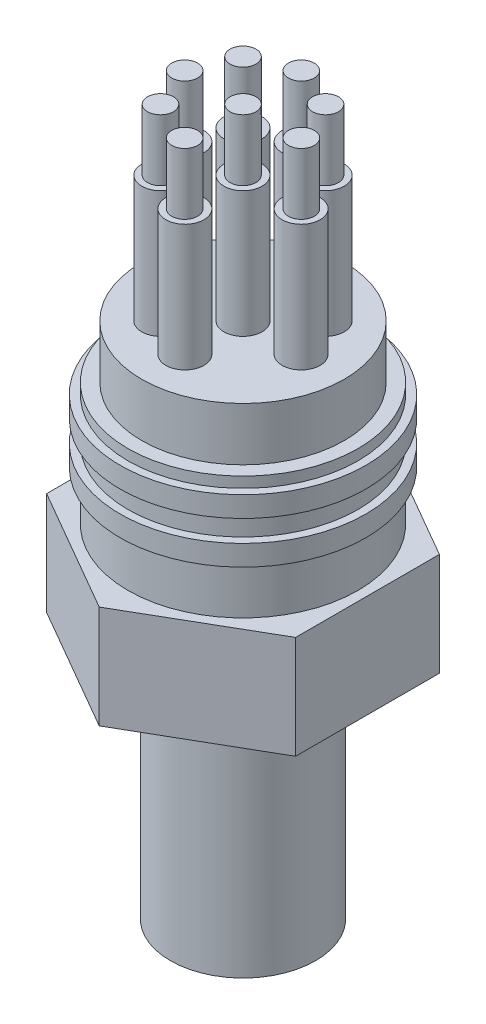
ISO-10303-21;
HEADER;
FILE_DESCRIPTION(('STEP AP214'),'2;1');
FILE_NAME('part.step','',(''),(''),'','','');
FILE_SCHEMA(('AUTOMOTIVE_DESIGN { 1 0 10303 214 1 1 1 1 }'));
ENDSEC;
DATA;
#1=APPLICATION_CONTEXT('core data for automotive mechanical design processes');
#2=APPLICATION_PROTOCOL_DEFINITION('international standard','automotive_design',2000,#1);
#3=PRODUCT_CONTEXT('',#1,'mechanical');
#4=PRODUCT('Part','Part','',(#3));
#5=PRODUCT_RELATED_PRODUCT_CATEGORY('part','',(#4));
#6=PRODUCT_DEFINITION_FORMATION('','',#4);
#7=PRODUCT_DEFINITION_CONTEXT('part definition',#1,'design');
#8=PRODUCT_DEFINITION('design','',#6,#7);
#9=PRODUCT_DEFINITION_SHAPE('','',#8);
#10=(LENGTH_UNIT() NAMED_UNIT(*) SI_UNIT(.MILLI.,.METRE.));
#11=(NAMED_UNIT(*) PLANE_ANGLE_UNIT() SI_UNIT($,.RADIAN.));
#12=(NAMED_UNIT(*) SI_UNIT($,.STERADIAN.) SOLID_ANGLE_UNIT());
#13=UNCERTAINTY_MEASURE_WITH_UNIT(LENGTH_MEASURE(1.E-05),#10,'distance_accuracy_value','');
#14=(GEOMETRIC_REPRESENTATION_CONTEXT(3) GLOBAL_UNCERTAINTY_ASSIGNED_CONTEXT((#13)) GLOBAL_UNIT_ASSIGNED_CONTEXT((#10,
#11,#12)) REPRESENTATION_CONTEXT('',''));
#15=CARTESIAN_POINT('',(0.,0.,0.));
#16=DIRECTION('',(0.,0.,1.));
#17=DIRECTION('',(1.,0.,0.));
#18=AXIS2_PLACEMENT_3D('',#15,#16,#17);
#19=CARTESIAN_POINT('',(9.52499999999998,7.874,-5.4992613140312));
#20=DIRECTION('',(-0.5,0.,0.866025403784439));
#21=DIRECTION('',(0.866025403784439,0.,0.5));
#22=AXIS2_PLACEMENT_3D('',#19,#20,#21);
#23=PLANE('',#22);
#24=DIRECTION('',(-0.866025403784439,0.,-0.5));
#25=VECTOR('',#24,1.);
#26=CARTESIAN_POINT('',(9.52499999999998,0.,-5.4992613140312));
#27=LINE('',#26,#25);
#28=CARTESIAN_POINT('',(9.52499999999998,0.,-5.4992613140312));
#29=VERTEX_POINT('',#28);
#30=CARTESIAN_POINT('',(0.,0.,-10.9985226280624));
#31=VERTEX_POINT('',#30);
#32=EDGE_CURVE('E121',#29,#31,#27,.T.);
#33=ORIENTED_EDGE('',*,*,#32,.T.);
#34=DIRECTION('',(0.,-1.,0.));
#35=VECTOR('',#34,1.);
#36=CARTESIAN_POINT('',(0.,7.874,-10.9985226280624));
#37=LINE('',#36,#35);
#38=CARTESIAN_POINT('',(0.,7.874,-10.9985226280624));
#39=VERTEX_POINT('',#38);
#40=EDGE_CURVE('E139',#39,#31,#37,.T.);
#41=ORIENTED_EDGE('',*,*,#40,.F.);
#42=DIRECTION('',(-0.866025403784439,0.,-0.5));
#43=VECTOR('',#42,1.);
#44=CARTESIAN_POINT('',(9.52499999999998,7.874,-5.4992613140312));
#45=LINE('',#44,#43);
#46=CARTESIAN_POINT('',(9.52499999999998,7.874,-5.4992613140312));
#47=VERTEX_POINT('',#46);
#48=EDGE_CURVE('E132',#47,#39,#45,.T.);
#49=ORIENTED_EDGE('',*,*,#48,.F.);
#50=DIRECTION('',(0.,-1.,0.));
#51=VECTOR('',#50,1.);
#52=CARTESIAN_POINT('',(9.52499999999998,7.874,-5.4992613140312));
#53=LINE('',#52,#51);
#54=EDGE_CURVE('E117',#47,#29,#53,.T.);
#55=ORIENTED_EDGE('',*,*,#54,.T.);
#56=EDGE_LOOP('',(#33,#41,#49,#55));
#57=FACE_BOUND('',#56,.T.);
#58=ADVANCED_FACE('F36',(#57),#23,.F.);
#59=CARTESIAN_POINT('',(0.,7.874,-10.9985226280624));
#60=DIRECTION('',(0.5,0.,0.866025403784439));
#61=DIRECTION('',(0.866025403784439,0.,-0.5));
#62=AXIS2_PLACEMENT_3D('',#59,#60,#61);
#63=PLANE('',#62);
#64=DIRECTION('',(-0.866025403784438,0.,0.5));
#65=VECTOR('',#64,1.);
#66=CARTESIAN_POINT('',(0.,0.,-10.9985226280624));
#67=LINE('',#66,#65);
#68=CARTESIAN_POINT('',(-9.52499999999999,0.,-5.49926131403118));
#69=VERTEX_POINT('',#68);
#70=EDGE_CURVE('E124',#31,#69,#67,.T.);
#71=ORIENTED_EDGE('',*,*,#70,.T.);
#72=DIRECTION('',(0.,-1.,0.));
#73=VECTOR('',#72,1.);
#74=CARTESIAN_POINT('',(-9.52499999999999,7.874,-5.49926131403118));
#75=LINE('',#74,#73);
#76=CARTESIAN_POINT('',(-9.52499999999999,7.874,-5.49926131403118));
#77=VERTEX_POINT('',#76);
#78=EDGE_CURVE('E136',#77,#69,#75,.T.);
#79=ORIENTED_EDGE('',*,*,#78,.F.);
#80=DIRECTION('',(-0.866025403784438,0.,0.5));
#81=VECTOR('',#80,1.);
#82=CARTESIAN_POINT('',(0.,7.874,-10.9985226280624));
#83=LINE('',#82,#81);
#84=EDGE_CURVE('E90',#39,#77,#83,.T.);
#85=ORIENTED_EDGE('',*,*,#84,.F.);
#86=ORIENTED_EDGE('',*,*,#40,.T.);
#87=EDGE_LOOP('',(#71,#79,#85,#86));
#88=FACE_BOUND('',#87,.T.);
#89=ADVANCED_FACE('F164',(#88),#63,.F.);
#90=CARTESIAN_POINT('',(-9.52499999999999,7.874,-5.49926131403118));
#91=DIRECTION('',(1.,0.,0.));
#92=DIRECTION('',(0.,0.,-1.));
#93=AXIS2_PLACEMENT_3D('',#90,#91,#92);
#94=PLANE('',#93);
#95=DIRECTION('',(0.,0.,1.));
#96=VECTOR('',#95,1.);
#97=CARTESIAN_POINT('',(-9.52499999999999,0.,-5.49926131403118));
#98=LINE('',#97,#96);
#99=CARTESIAN_POINT('',(-9.52499999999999,0.,5.49926131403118));
#100=VERTEX_POINT('',#99);
#101=EDGE_CURVE('E127',#69,#100,#98,.T.);
#102=ORIENTED_EDGE('',*,*,#101,.T.);
#103=DIRECTION('',(0.,-1.,0.));
#104=VECTOR('',#103,1.);
#105=CARTESIAN_POINT('',(-9.52499999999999,7.874,5.49926131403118));
#106=LINE('',#105,#104);
#107=CARTESIAN_POINT('',(-9.52499999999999,7.874,5.49926131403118));
#108=VERTEX_POINT('',#107);
#109=EDGE_CURVE('E112',#108,#100,#106,.T.);
#110=ORIENTED_EDGE('',*,*,#109,.F.);
#111=DIRECTION('',(0.,0.,1.));
#112=VECTOR('',#111,1.);
#113=CARTESIAN_POINT('',(-9.52499999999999,7.874,-5.49926131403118));
#114=LINE('',#113,#112);
#115=EDGE_CURVE('E103',#77,#108,#114,.T.);
#116=ORIENTED_EDGE('',*,*,#115,.F.);
#117=ORIENTED_EDGE('',*,*,#78,.T.);
#118=EDGE_LOOP('',(#102,#110,#116,#117));
#119=FACE_BOUND('',#118,.T.);
#120=ADVANCED_FACE('F167',(#119),#94,.F.);
#121=CARTESIAN_POINT('',(-9.52499999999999,7.874,5.49926131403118));
#122=DIRECTION('',(0.5,0.,-0.866025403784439));
#123=DIRECTION('',(-0.866025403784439,0.,-0.5));
#124=AXIS2_PLACEMENT_3D('',#121,#122,#123);
#125=PLANE('',#124);
#126=DIRECTION('',(0.866025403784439,0.,0.5));
#127=VECTOR('',#126,1.);
#128=CARTESIAN_POINT('',(-9.52499999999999,0.,5.49926131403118));
#129=LINE('',#128,#127);
#130=CARTESIAN_POINT('',(0.,0.,10.9985226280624));
#131=VERTEX_POINT('',#130);
#132=EDGE_CURVE('E111',#100,#131,#129,.T.);
#133=ORIENTED_EDGE('',*,*,#132,.T.);
#134=DIRECTION('',(0.,-1.,0.));
#135=VECTOR('',#134,1.);
#136=CARTESIAN_POINT('',(0.,7.874,10.9985226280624));
#137=LINE('',#136,#135);
#138=CARTESIAN_POINT('',(0.,7.874,10.9985226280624));
#139=VERTEX_POINT('',#138);
#140=EDGE_CURVE('E108',#139,#131,#137,.T.);
#141=ORIENTED_EDGE('',*,*,#140,.F.);
#142=DIRECTION('',(0.866025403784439,0.,0.5));
#143=VECTOR('',#142,1.);
#144=CARTESIAN_POINT('',(-9.52499999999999,7.874,5.49926131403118));
#145=LINE('',#144,#143);
#146=EDGE_CURVE('E97',#108,#139,#145,.T.);
#147=ORIENTED_EDGE('',*,*,#146,.F.);
#148=ORIENTED_EDGE('',*,*,#109,.T.);
#149=EDGE_LOOP('',(#133,#141,#147,#148));
#150=FACE_BOUND('',#149,.T.);
#151=ADVANCED_FACE('F109',(#150),#125,.F.);
#152=CARTESIAN_POINT('',(0.,7.874,10.9985226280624));
#153=DIRECTION('',(-0.5,0.,-0.866025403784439));
#154=DIRECTION('',(-0.866025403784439,0.,0.5));
#155=AXIS2_PLACEMENT_3D('',#152,#153,#154);
#156=PLANE('',#155);
#157=DIRECTION('',(0.866025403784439,0.,-0.5));
#158=VECTOR('',#157,1.);
#159=CARTESIAN_POINT('',(0.,0.,10.9985226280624));
#160=LINE('',#159,#158);
#161=CARTESIAN_POINT('',(9.52499999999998,0.,5.49926131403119));
#162=VERTEX_POINT('',#161);
#163=EDGE_CURVE('E75',#131,#162,#160,.T.);
#164=ORIENTED_EDGE('',*,*,#163,.T.);
#165=DIRECTION('',(0.,-1.,0.));
#166=VECTOR('',#165,1.);
#167=CARTESIAN_POINT('',(9.52499999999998,7.874,5.49926131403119));
#168=LINE('',#167,#166);
#169=CARTESIAN_POINT('',(9.52499999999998,7.874,5.49926131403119));
#170=VERTEX_POINT('',#169);
#171=EDGE_CURVE('E113',#170,#162,#168,.T.);
#172=ORIENTED_EDGE('',*,*,#171,.F.);
#173=DIRECTION('',(0.866025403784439,0.,-0.5));
#174=VECTOR('',#173,1.);
#175=CARTESIAN_POINT('',(0.,7.874,10.9985226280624));
#176=LINE('',#175,#174);
#177=EDGE_CURVE('E101',#139,#170,#176,.T.);
#178=ORIENTED_EDGE('',*,*,#177,.F.);
#179=ORIENTED_EDGE('',*,*,#140,.T.);
#180=EDGE_LOOP('',(#164,#172,#178,#179));
#181=FACE_BOUND('',#180,.T.);
#182=ADVANCED_FACE('F115',(#181),#156,.F.);
#183=CARTESIAN_POINT('',(9.52499999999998,7.874,5.49926131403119));
#184=DIRECTION('',(-1.,0.,0.));
#185=DIRECTION('',(0.,0.,1.));
#186=AXIS2_PLACEMENT_3D('',#183,#184,#185);
#187=PLANE('',#186);
#188=DIRECTION('',(0.,0.,-1.));
#189=VECTOR('',#188,1.);
#190=CARTESIAN_POINT('',(9.52499999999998,0.,5.49926131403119));
#191=LINE('',#190,#189);
#192=EDGE_CURVE('E81',#162,#29,#191,.T.);
#193=ORIENTED_EDGE('',*,*,#192,.T.);
#194=ORIENTED_EDGE('',*,*,#54,.F.);
#195=DIRECTION('',(0.,0.,-1.));
#196=VECTOR('',#195,1.);
#197=CARTESIAN_POINT('',(9.52499999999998,7.874,5.49926131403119));
#198=LINE('',#197,#196);
#199=EDGE_CURVE('E52',#170,#47,#198,.T.);
#200=ORIENTED_EDGE('',*,*,#199,.F.);
#201=ORIENTED_EDGE('',*,*,#171,.T.);
#202=EDGE_LOOP('',(#193,#194,#200,#201));
#203=FACE_BOUND('',#202,.T.);
#204=ADVANCED_FACE('F171',(#203),#187,.F.);
#205=CARTESIAN_POINT('',(-9.52499999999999,7.874,-16.4977839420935));
#206=DIRECTION('',(0.,1.,0.));
#207=DIRECTION('',(0.,0.,1.));
#208=AXIS2_PLACEMENT_3D('',#205,#206,#207);
#209=PLANE('',#208);
#210=CARTESIAN_POINT('',(0.,7.874,0.));
#211=DIRECTION('',(0.,1.,0.));
#212=DIRECTION('',(-1.,0.,0.));
#213=AXIS2_PLACEMENT_3D('',#210,#211,#212);
#214=CIRCLE('',#213,8.8011);
#215=CARTESIAN_POINT('',(-8.8011,7.874,0.));
#216=VERTEX_POINT('',#215);
#217=EDGE_CURVE('E793',#216,#216,#214,.T.);
#218=ORIENTED_EDGE('',*,*,#217,.F.);
#219=EDGE_LOOP('',(#218));
#220=FACE_BOUND('',#219,.T.);
#221=ORIENTED_EDGE('',*,*,#48,.T.);
#222=ORIENTED_EDGE('',*,*,#84,.T.);
#223=ORIENTED_EDGE('',*,*,#115,.T.);
#224=ORIENTED_EDGE('',*,*,#146,.T.);
#225=ORIENTED_EDGE('',*,*,#177,.T.);
#226=ORIENTED_EDGE('',*,*,#199,.T.);
#227=EDGE_LOOP('',(#221,#222,#223,#224,#225,#226));
#228=FACE_BOUND('',#227,.T.);
#229=ADVANCED_FACE('F99',(#220,#228),#209,.T.);
#230=CARTESIAN_POINT('',(-9.52499999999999,0.,-16.4977839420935));
#231=DIRECTION('',(0.,1.,0.));
#232=DIRECTION('',(0.,0.,1.));
#233=AXIS2_PLACEMENT_3D('',#230,#231,#232);
#234=PLANE('',#233);
#235=CARTESIAN_POINT('',(0.,0.,0.));
#236=DIRECTION('',(0.,1.,0.));
#237=DIRECTION('',(0.,0.,1.));
#238=AXIS2_PLACEMENT_3D('',#235,#236,#237);
#239=CIRCLE('',#238,5.55625);
#240=CARTESIAN_POINT('',(0.,0.,5.55625));
#241=VERTEX_POINT('',#240);
#242=EDGE_CURVE('E11',#241,#241,#239,.F.);
#243=ORIENTED_EDGE('',*,*,#242,.F.);
#244=EDGE_LOOP('',(#243));
#245=FACE_BOUND('',#244,.T.);
#246=ORIENTED_EDGE('',*,*,#32,.F.);
#247=ORIENTED_EDGE('',*,*,#192,.F.);
#248=ORIENTED_EDGE('',*,*,#163,.F.);
#249=ORIENTED_EDGE('',*,*,#132,.F.);
#250=ORIENTED_EDGE('',*,*,#101,.F.);
#251=ORIENTED_EDGE('',*,*,#70,.F.);
#252=EDGE_LOOP('',(#246,#247,#248,#249,#250,#251));
#253=FACE_BOUND('',#252,.T.);
#254=ADVANCED_FACE('F149',(#245,#253),#234,.F.);
#255=CARTESIAN_POINT('',(8.8011,17.272,0.));
#256=DIRECTION('',(0.,-1.,0.));
#257=DIRECTION('',(1.,0.,0.));
#258=AXIS2_PLACEMENT_3D('',#255,#256,#257);
#259=PLANE('',#258);
#260=CARTESIAN_POINT('',(0.,17.272,0.));
#261=DIRECTION('',(0.,-1.,0.));
#262=DIRECTION('',(1.,0.,0.));
#263=AXIS2_PLACEMENT_3D('',#260,#261,#262);
#264=CIRCLE('',#263,7.747);
#265=CARTESIAN_POINT('',(7.747,17.272,0.));
#266=VERTEX_POINT('',#265);
#267=EDGE_CURVE('E44',#266,#266,#264,.F.);
#268=ORIENTED_EDGE('',*,*,#267,.F.);
#269=EDGE_LOOP('',(#268));
#270=FACE_BOUND('',#269,.T.);
#271=CARTESIAN_POINT('',(0.,17.272,0.));
#272=DIRECTION('',(0.,1.,0.));
#273=DIRECTION('',(-1.,0.,0.));
#274=AXIS2_PLACEMENT_3D('',#271,#272,#273);
#275=CIRCLE('',#274,8.8011);
#276=CARTESIAN_POINT('',(-8.8011,17.272,0.));
#277=VERTEX_POINT('',#276);
#278=EDGE_CURVE('E125',#277,#277,#275,.T.);
#279=ORIENTED_EDGE('',*,*,#278,.T.);
#280=EDGE_LOOP('',(#279));
#281=FACE_BOUND('',#280,.T.);
#282=ADVANCED_FACE('F145',(#270,#281),#259,.F.);
#283=CARTESIAN_POINT('',(0.,0.,0.));
#284=DIRECTION('',(0.,1.,0.));
#285=DIRECTION('',(-1.,0.,0.));
#286=AXIS2_PLACEMENT_3D('',#283,#284,#285);
#287=CYLINDRICAL_SURFACE('',#286,8.8011);
#288=ORIENTED_EDGE('',*,*,#278,.F.);
#289=EDGE_LOOP('',(#288));
#290=FACE_BOUND('',#289,.T.);
#291=CARTESIAN_POINT('',(0.,16.4592,0.));
#292=DIRECTION('',(0.,1.,0.));
#293=DIRECTION('',(-1.,0.,0.));
#294=AXIS2_PLACEMENT_3D('',#291,#292,#293);
#295=CIRCLE('',#294,8.8011);
#296=CARTESIAN_POINT('',(-8.8011,16.4592,0.));
#297=VERTEX_POINT('',#296);
#298=EDGE_CURVE('E154',#297,#297,#295,.T.);
#299=ORIENTED_EDGE('',*,*,#298,.T.);
#300=EDGE_LOOP('',(#299));
#301=FACE_BOUND('',#300,.T.);
#302=ADVANCED_FACE('F148',(#290,#301),#287,.T.);
#303=CARTESIAN_POINT('',(9.398,16.4592,0.));
#304=DIRECTION('',(0.,-1.,0.));
#305=DIRECTION('',(1.,0.,0.));
#306=AXIS2_PLACEMENT_3D('',#303,#304,#305);
#307=PLANE('',#306);
#308=ORIENTED_EDGE('',*,*,#298,.F.);
#309=EDGE_LOOP('',(#308));
#310=FACE_BOUND('',#309,.T.);
#311=CARTESIAN_POINT('',(0.,16.4592,0.));
#312=DIRECTION('',(0.,1.,0.));
#313=DIRECTION('',(-1.,0.,0.));
#314=AXIS2_PLACEMENT_3D('',#311,#312,#313);
#315=CIRCLE('',#314,9.398);
#316=CARTESIAN_POINT('',(-9.398,16.4592,0.));
#317=VERTEX_POINT('',#316);
#318=EDGE_CURVE('E157',#317,#317,#315,.T.);
#319=ORIENTED_EDGE('',*,*,#318,.T.);
#320=EDGE_LOOP('',(#319));
#321=FACE_BOUND('',#320,.T.);
#322=ADVANCED_FACE('F221',(#310,#321),#307,.F.);
#323=CARTESIAN_POINT('',(0.,0.,0.));
#324=DIRECTION('',(0.,1.,0.));
#325=DIRECTION('',(-1.,0.,0.));
#326=AXIS2_PLACEMENT_3D('',#323,#324,#325);
#327=CYLINDRICAL_SURFACE('',#326,9.398);
#328=ORIENTED_EDGE('',*,*,#318,.F.);
#329=EDGE_LOOP('',(#328));
#330=FACE_BOUND('',#329,.T.);
#331=CARTESIAN_POINT('',(0.,14.8844,0.));
#332=DIRECTION('',(0.,1.,0.));
#333=DIRECTION('',(-1.,0.,0.));
#334=AXIS2_PLACEMENT_3D('',#331,#332,#333);
#335=CIRCLE('',#334,9.398);
#336=CARTESIAN_POINT('',(-9.398,14.8844,0.));
#337=VERTEX_POINT('',#336);
#338=EDGE_CURVE('E811',#337,#337,#335,.T.);
#339=ORIENTED_EDGE('',*,*,#338,.T.);
#340=EDGE_LOOP('',(#339));
#341=FACE_BOUND('',#340,.T.);
#342=ADVANCED_FACE('F231',(#330,#341),#327,.T.);
#343=CARTESIAN_POINT('',(8.8011,14.8844,0.));
#344=DIRECTION('',(0.,1.,0.));
#345=DIRECTION('',(-1.,0.,0.));
#346=AXIS2_PLACEMENT_3D('',#343,#344,#345);
#347=PLANE('',#346);
#348=ORIENTED_EDGE('',*,*,#338,.F.);
#349=EDGE_LOOP('',(#348));
#350=FACE_BOUND('',#349,.T.);
#351=CARTESIAN_POINT('',(0.,14.8844,0.));
#352=DIRECTION('',(0.,1.,0.));
#353=DIRECTION('',(-1.,0.,0.));
#354=AXIS2_PLACEMENT_3D('',#351,#352,#353);
#355=CIRCLE('',#354,8.8011);
#356=CARTESIAN_POINT('',(-8.8011,14.8844,0.));
#357=VERTEX_POINT('',#356);
#358=EDGE_CURVE('E808',#357,#357,#355,.T.);
#359=ORIENTED_EDGE('',*,*,#358,.T.);
#360=EDGE_LOOP('',(#359));
#361=FACE_BOUND('',#360,.T.);
#362=ADVANCED_FACE('F241',(#350,#361),#347,.F.);
#363=CARTESIAN_POINT('',(0.,0.,0.));
#364=DIRECTION('',(0.,1.,0.));
#365=DIRECTION('',(-1.,0.,0.));
#366=AXIS2_PLACEMENT_3D('',#363,#364,#365);
#367=CYLINDRICAL_SURFACE('',#366,8.8011);
#368=ORIENTED_EDGE('',*,*,#358,.F.);
#369=EDGE_LOOP('',(#368));
#370=FACE_BOUND('',#369,.T.);
#371=CARTESIAN_POINT('',(0.,13.2334,0.));
#372=DIRECTION('',(0.,1.,0.));
#373=DIRECTION('',(-1.,0.,0.));
#374=AXIS2_PLACEMENT_3D('',#371,#372,#373);
#375=CIRCLE('',#374,8.8011);
#376=CARTESIAN_POINT('',(-8.8011,13.2334,0.));
#377=VERTEX_POINT('',#376);
#378=EDGE_CURVE('E805',#377,#377,#375,.T.);
#379=ORIENTED_EDGE('',*,*,#378,.T.);
#380=EDGE_LOOP('',(#379));
#381=FACE_BOUND('',#380,.T.);
#382=ADVANCED_FACE('F251',(#370,#381),#367,.T.);
#383=CARTESIAN_POINT('',(9.398,13.2334,0.));
#384=DIRECTION('',(0.,-1.,0.));
#385=DIRECTION('',(1.,0.,0.));
#386=AXIS2_PLACEMENT_3D('',#383,#384,#385);
#387=PLANE('',#386);
#388=ORIENTED_EDGE('',*,*,#378,.F.);
#389=EDGE_LOOP('',(#388));
#390=FACE_BOUND('',#389,.T.);
#391=CARTESIAN_POINT('',(0.,13.2334,0.));
#392=DIRECTION('',(0.,1.,0.));
#393=DIRECTION('',(-1.,0.,0.));
#394=AXIS2_PLACEMENT_3D('',#391,#392,#393);
#395=CIRCLE('',#394,9.398);
#396=CARTESIAN_POINT('',(-9.398,13.2334,0.));
#397=VERTEX_POINT('',#396);
#398=EDGE_CURVE('E802',#397,#397,#395,.T.);
#399=ORIENTED_EDGE('',*,*,#398,.T.);
#400=EDGE_LOOP('',(#399));
#401=FACE_BOUND('',#400,.T.);
#402=ADVANCED_FACE('F261',(#390,#401),#387,.F.);
#403=CARTESIAN_POINT('',(0.,0.,0.));
#404=DIRECTION('',(0.,1.,0.));
#405=DIRECTION('',(-1.,0.,0.));
#406=AXIS2_PLACEMENT_3D('',#403,#404,#405);
#407=CYLINDRICAL_SURFACE('',#406,9.398);
#408=ORIENTED_EDGE('',*,*,#398,.F.);
#409=EDGE_LOOP('',(#408));
#410=FACE_BOUND('',#409,.T.);
#411=CARTESIAN_POINT('',(0.,11.6586,0.));
#412=DIRECTION('',(0.,1.,0.));
#413=DIRECTION('',(-1.,0.,0.));
#414=AXIS2_PLACEMENT_3D('',#411,#412,#413);
#415=CIRCLE('',#414,9.398);
#416=CARTESIAN_POINT('',(-9.398,11.6586,0.));
#417=VERTEX_POINT('',#416);
#418=EDGE_CURVE('E799',#417,#417,#415,.T.);
#419=ORIENTED_EDGE('',*,*,#418,.T.);
#420=EDGE_LOOP('',(#419));
#421=FACE_BOUND('',#420,.T.);
#422=ADVANCED_FACE('F271',(#410,#421),#407,.T.);
#423=CARTESIAN_POINT('',(8.80109999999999,11.6586,0.));
#424=DIRECTION('',(0.,1.,0.));
#425=DIRECTION('',(-1.,0.,0.));
#426=AXIS2_PLACEMENT_3D('',#423,#424,#425);
#427=PLANE('',#426);
#428=ORIENTED_EDGE('',*,*,#418,.F.);
#429=EDGE_LOOP('',(#428));
#430=FACE_BOUND('',#429,.T.);
#431=CARTESIAN_POINT('',(0.,11.6586,0.));
#432=DIRECTION('',(0.,1.,0.));
#433=DIRECTION('',(-1.,0.,0.));
#434=AXIS2_PLACEMENT_3D('',#431,#432,#433);
#435=CIRCLE('',#434,8.8011);
#436=CARTESIAN_POINT('',(-8.8011,11.6586,0.));
#437=VERTEX_POINT('',#436);
#438=EDGE_CURVE('E796',#437,#437,#435,.T.);
#439=ORIENTED_EDGE('',*,*,#438,.T.);
#440=EDGE_LOOP('',(#439));
#441=FACE_BOUND('',#440,.T.);
#442=ADVANCED_FACE('F281',(#430,#441),#427,.F.);
#443=CARTESIAN_POINT('',(0.,0.,0.));
#444=DIRECTION('',(0.,1.,0.));
#445=DIRECTION('',(-1.,0.,0.));
#446=AXIS2_PLACEMENT_3D('',#443,#444,#445);
#447=CYLINDRICAL_SURFACE('',#446,8.8011);
#448=ORIENTED_EDGE('',*,*,#438,.F.);
#449=EDGE_LOOP('',(#448));
#450=FACE_BOUND('',#449,.T.);
#451=ORIENTED_EDGE('',*,*,#217,.T.);
#452=EDGE_LOOP('',(#451));
#453=FACE_BOUND('',#452,.T.);
#454=ADVANCED_FACE('F291',(#450,#453),#447,.T.);
#455=CARTESIAN_POINT('',(0.,21.336,0.));
#456=DIRECTION('',(0.,-1.,0.));
#457=DIRECTION('',(1.,0.,0.));
#458=AXIS2_PLACEMENT_3D('',#455,#456,#457);
#459=CYLINDRICAL_SURFACE('',#458,7.747);
#460=CARTESIAN_POINT('',(0.,21.336,0.));
#461=DIRECTION('',(0.,1.,0.));
#462=DIRECTION('',(-1.,0.,0.));
#463=AXIS2_PLACEMENT_3D('',#460,#461,#462);
#464=CIRCLE('',#463,7.747);
#465=CARTESIAN_POINT('',(-7.747,21.336,0.));
#466=VERTEX_POINT('',#465);
#467=EDGE_CURVE('E788',#466,#466,#464,.T.);
#468=ORIENTED_EDGE('',*,*,#467,.F.);
#469=EDGE_LOOP('',(#468));
#470=FACE_BOUND('',#469,.T.);
#471=ORIENTED_EDGE('',*,*,#267,.T.);
#472=EDGE_LOOP('',(#471));
#473=FACE_BOUND('',#472,.T.);
#474=ADVANCED_FACE('F143',(#470,#473),#459,.T.);
#475=CARTESIAN_POINT('',(0.,21.336,0.));
#476=DIRECTION('',(0.,1.,0.));
#477=DIRECTION('',(-1.,0.,0.));
#478=AXIS2_PLACEMENT_3D('',#475,#476,#477);
#479=PLANE('',#478);
#480=CARTESIAN_POINT('',(0.,21.336,0.));
#481=DIRECTION('',(0.,1.,0.));
#482=DIRECTION('',(-1.,0.,0.));
#483=AXIS2_PLACEMENT_3D('',#480,#481,#482);
#484=CIRCLE('',#483,1.4605);
#485=CARTESIAN_POINT('',(-1.4605,21.336,0.));
#486=VERTEX_POINT('',#485);
#487=EDGE_CURVE('E699',#486,#486,#484,.T.);
#488=ORIENTED_EDGE('',*,*,#487,.F.);
#489=EDGE_LOOP('',(#488));
#490=FACE_BOUND('',#489,.T.);
#491=CARTESIAN_POINT('',(-3.14308964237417,21.336,-3.14308964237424));
#492=DIRECTION('',(0.,1.,0.));
#493=DIRECTION('',(-0.707106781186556,0.,0.707106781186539));
#494=AXIS2_PLACEMENT_3D('',#491,#492,#493);
#495=CIRCLE('',#494,1.4605);
#496=CARTESIAN_POINT('',(-4.17581909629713,21.336,-2.1103601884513));
#497=VERTEX_POINT('',#496);
#498=EDGE_CURVE('E740',#497,#497,#495,.T.);
#499=ORIENTED_EDGE('',*,*,#498,.F.);
#500=EDGE_LOOP('',(#499));
#501=FACE_BOUND('',#500,.T.);
#502=CARTESIAN_POINT('',(-4.445,21.336,0.));
#503=DIRECTION('',(0.,1.,0.));
#504=DIRECTION('',(0.,0.,1.));
#505=AXIS2_PLACEMENT_3D('',#502,#503,#504);
#506=CIRCLE('',#505,1.4605);
#507=CARTESIAN_POINT('',(-4.44500000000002,21.336,1.46049999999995));
#508=VERTEX_POINT('',#507);
#509=EDGE_CURVE('E746',#508,#508,#506,.T.);
#510=ORIENTED_EDGE('',*,*,#509,.F.);
#511=EDGE_LOOP('',(#510));
#512=FACE_BOUND('',#511,.T.);
#513=CARTESIAN_POINT('',(-3.14308964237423,21.336,3.14308964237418));
#514=DIRECTION('',(0.,1.,0.));
#515=DIRECTION('',(0.707106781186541,0.,0.707106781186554));
#516=AXIS2_PLACEMENT_3D('',#513,#514,#515);
#517=CIRCLE('',#516,1.4605);
#518=CARTESIAN_POINT('',(-2.11036018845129,21.336,4.17581909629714));
#519=VERTEX_POINT('',#518);
#520=EDGE_CURVE('E752',#519,#519,#517,.T.);
#521=ORIENTED_EDGE('',*,*,#520,.F.);
#522=EDGE_LOOP('',(#521));
#523=FACE_BOUND('',#522,.T.);
#524=CARTESIAN_POINT('',(0.,21.336,4.445));
#525=DIRECTION('',(0.,1.,0.));
#526=DIRECTION('',(1.,0.,0.));
#527=AXIS2_PLACEMENT_3D('',#524,#525,#526);
#528=CIRCLE('',#527,1.4605);
#529=CARTESIAN_POINT('',(1.46049999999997,21.336,4.44500000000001));
#530=VERTEX_POINT('',#529);
#531=EDGE_CURVE('E758',#530,#530,#528,.T.);
#532=ORIENTED_EDGE('',*,*,#531,.F.);
#533=EDGE_LOOP('',(#532));
#534=FACE_BOUND('',#533,.T.);
#535=CARTESIAN_POINT('',(4.445,21.336,0.));
#536=DIRECTION('',(0.,1.,0.));
#537=DIRECTION('',(0.,0.,-1.));
#538=AXIS2_PLACEMENT_3D('',#535,#536,#537);
#539=CIRCLE('',#538,1.4605);
#540=CARTESIAN_POINT('',(4.445,21.336,-1.46049999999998));
#541=VERTEX_POINT('',#540);
#542=EDGE_CURVE('E764',#541,#541,#539,.T.);
#543=ORIENTED_EDGE('',*,*,#542,.F.);
#544=EDGE_LOOP('',(#543));
#545=FACE_BOUND('',#544,.T.);
#546=CARTESIAN_POINT('',(3.14308964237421,21.336,-3.1430896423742));
#547=DIRECTION('',(0.,1.,0.));
#548=DIRECTION('',(-0.707106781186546,0.,-0.707106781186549));
#549=AXIS2_PLACEMENT_3D('',#546,#547,#548);
#550=CIRCLE('',#549,1.4605);
#551=CARTESIAN_POINT('',(2.11036018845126,21.336,-4.17581909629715));
#552=VERTEX_POINT('',#551);
#553=EDGE_CURVE('E770',#552,#552,#550,.T.);
#554=ORIENTED_EDGE('',*,*,#553,.F.);
#555=EDGE_LOOP('',(#554));
#556=FACE_BOUND('',#555,.T.);
#557=CARTESIAN_POINT('',(0.,21.336,-4.445));
#558=DIRECTION('',(0.,1.,0.));
#559=DIRECTION('',(-1.,0.,0.));
#560=AXIS2_PLACEMENT_3D('',#557,#558,#559);
#561=CIRCLE('',#560,1.4605);
#562=CARTESIAN_POINT('',(-1.4605,21.336,-4.445));
#563=VERTEX_POINT('',#562);
#564=EDGE_CURVE('E782',#563,#563,#561,.T.);
#565=ORIENTED_EDGE('',*,*,#564,.F.);
#566=EDGE_LOOP('',(#565));
#567=FACE_BOUND('',#566,.T.);
#568=ORIENTED_EDGE('',*,*,#467,.T.);
#569=EDGE_LOOP('',(#568));
#570=FACE_BOUND('',#569,.T.);
#571=ADVANCED_FACE('F315',(#490,#501,#512,#523,#534,#545,#556,#567,#570),#479,.T.);
#572=CARTESIAN_POINT('',(0.,30.988,-4.445));
#573=DIRECTION('',(0.,-1.,0.));
#574=DIRECTION('',(1.,0.,0.));
#575=AXIS2_PLACEMENT_3D('',#572,#573,#574);
#576=CYLINDRICAL_SURFACE('',#575,1.4605);
#577=CARTESIAN_POINT('',(0.,30.988,-4.445));
#578=DIRECTION('',(0.,1.,0.));
#579=DIRECTION('',(-1.,0.,0.));
#580=AXIS2_PLACEMENT_3D('',#577,#578,#579);
#581=CIRCLE('',#580,1.4605);
#582=CARTESIAN_POINT('',(-1.4605,30.988,-4.445));
#583=VERTEX_POINT('',#582);
#584=EDGE_CURVE('E785',#583,#583,#581,.T.);
#585=ORIENTED_EDGE('',*,*,#584,.F.);
#586=EDGE_LOOP('',(#585));
#587=FACE_BOUND('',#586,.T.);
#588=ORIENTED_EDGE('',*,*,#564,.T.);
#589=EDGE_LOOP('',(#588));
#590=FACE_BOUND('',#589,.T.);
#591=ADVANCED_FACE('F323',(#587,#590),#576,.T.);
#592=CARTESIAN_POINT('',(0.,30.988,-4.445));
#593=DIRECTION('',(0.,1.,0.));
#594=DIRECTION('',(-1.,0.,0.));
#595=AXIS2_PLACEMENT_3D('',#592,#593,#594);
#596=PLANE('',#595);
#597=CARTESIAN_POINT('',(0.,30.988,-4.4639335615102));
#598=DIRECTION('',(0.,1.,0.));
#599=DIRECTION('',(-1.,0.,0.));
#600=AXIS2_PLACEMENT_3D('',#597,#598,#599);
#601=CIRCLE('',#600,0.9906);
#602=CARTESIAN_POINT('',(-0.990600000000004,30.988,-4.4639335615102));
#603=VERTEX_POINT('',#602);
#604=EDGE_CURVE('E776',#603,#603,#601,.T.);
#605=ORIENTED_EDGE('',*,*,#604,.F.);
#606=EDGE_LOOP('',(#605));
#607=FACE_BOUND('',#606,.T.);
#608=ORIENTED_EDGE('',*,*,#584,.T.);
#609=EDGE_LOOP('',(#608));
#610=FACE_BOUND('',#609,.T.);
#611=ADVANCED_FACE('F328',(#607,#610),#596,.T.);
#612=CARTESIAN_POINT('',(0.,35.687,-4.4639335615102));
#613=DIRECTION('',(0.,-1.,0.));
#614=DIRECTION('',(1.,0.,0.));
#615=AXIS2_PLACEMENT_3D('',#612,#613,#614);
#616=CYLINDRICAL_SURFACE('',#615,0.9906);
#617=CARTESIAN_POINT('',(0.,35.687,-4.4639335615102));
#618=DIRECTION('',(0.,1.,0.));
#619=DIRECTION('',(-1.,0.,0.));
#620=AXIS2_PLACEMENT_3D('',#617,#618,#619);
#621=CIRCLE('',#620,0.9906);
#622=CARTESIAN_POINT('',(-0.990600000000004,35.687,-4.4639335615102));
#623=VERTEX_POINT('',#622);
#624=EDGE_CURVE('E779',#623,#623,#621,.T.);
#625=ORIENTED_EDGE('',*,*,#624,.F.);
#626=EDGE_LOOP('',(#625));
#627=FACE_BOUND('',#626,.T.);
#628=ORIENTED_EDGE('',*,*,#604,.T.);
#629=EDGE_LOOP('',(#628));
#630=FACE_BOUND('',#629,.T.);
#631=ADVANCED_FACE('F338',(#627,#630),#616,.T.);
#632=CARTESIAN_POINT('',(0.,35.687,-4.4639335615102));
#633=DIRECTION('',(0.,1.,0.));
#634=DIRECTION('',(-1.,0.,0.));
#635=AXIS2_PLACEMENT_3D('',#632,#633,#634);
#636=PLANE('',#635);
#637=ORIENTED_EDGE('',*,*,#624,.T.);
#638=EDGE_LOOP('',(#637));
#639=FACE_BOUND('',#638,.T.);
#640=ADVANCED_FACE('F348',(#639),#636,.T.);
#641=CARTESIAN_POINT('',(3.14308964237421,30.988,-3.1430896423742));
#642=DIRECTION('',(0.,-1.,0.));
#643=DIRECTION('',(1.,0.,0.));
#644=AXIS2_PLACEMENT_3D('',#641,#642,#643);
#645=CYLINDRICAL_SURFACE('',#644,1.4605);
#646=CARTESIAN_POINT('',(3.14308964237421,30.988,-3.1430896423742));
#647=DIRECTION('',(0.,1.,0.));
#648=DIRECTION('',(-0.707106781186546,0.,-0.707106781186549));
#649=AXIS2_PLACEMENT_3D('',#646,#647,#648);
#650=CIRCLE('',#649,1.4605);
#651=CARTESIAN_POINT('',(2.11036018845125,30.988,-4.17581909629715));
#652=VERTEX_POINT('',#651);
#653=EDGE_CURVE('E773',#652,#652,#650,.T.);
#654=ORIENTED_EDGE('',*,*,#653,.F.);
#655=EDGE_LOOP('',(#654));
#656=FACE_BOUND('',#655,.T.);
#657=ORIENTED_EDGE('',*,*,#553,.T.);
#658=EDGE_LOOP('',(#657));
#659=FACE_BOUND('',#658,.T.);
#660=ADVANCED_FACE('F358',(#656,#659),#645,.T.);
#661=CARTESIAN_POINT('',(3.14308964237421,30.988,-3.1430896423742));
#662=DIRECTION('',(0.,1.,0.));
#663=DIRECTION('',(-0.707106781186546,0.,-0.707106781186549));
#664=AXIS2_PLACEMENT_3D('',#661,#662,#663);
#665=PLANE('',#664);
#666=CARTESIAN_POINT('',(3.15647769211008,30.988,-3.15647769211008));
#667=DIRECTION('',(0.,1.,0.));
#668=DIRECTION('',(-0.707106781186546,0.,-0.707106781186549));
#669=AXIS2_PLACEMENT_3D('',#666,#667,#668);
#670=CIRCLE('',#669,0.9906);
#671=CARTESIAN_POINT('',(2.45601771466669,30.988,-3.85693766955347));
#672=VERTEX_POINT('',#671);
#673=EDGE_CURVE('E734',#672,#672,#670,.T.);
#674=ORIENTED_EDGE('',*,*,#673,.F.);
#675=EDGE_LOOP('',(#674));
#676=FACE_BOUND('',#675,.T.);
#677=ORIENTED_EDGE('',*,*,#653,.T.);
#678=EDGE_LOOP('',(#677));
#679=FACE_BOUND('',#678,.T.);
#680=ADVANCED_FACE('F368',(#676,#679),#665,.T.);
#681=CARTESIAN_POINT('',(4.445,30.988,0.));
#682=DIRECTION('',(0.,-1.,0.));
#683=DIRECTION('',(1.,0.,0.));
#684=AXIS2_PLACEMENT_3D('',#681,#682,#683);
#685=CYLINDRICAL_SURFACE('',#684,1.4605);
#686=CARTESIAN_POINT('',(4.445,30.988,0.));
#687=DIRECTION('',(0.,1.,0.));
#688=DIRECTION('',(0.,0.,-1.));
#689=AXIS2_PLACEMENT_3D('',#686,#687,#688);
#690=CIRCLE('',#689,1.4605);
#691=CARTESIAN_POINT('',(4.445,30.988,-1.46049999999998));
#692=VERTEX_POINT('',#691);
#693=EDGE_CURVE('E767',#692,#692,#690,.T.);
#694=ORIENTED_EDGE('',*,*,#693,.F.);
#695=EDGE_LOOP('',(#694));
#696=FACE_BOUND('',#695,.T.);
#697=ORIENTED_EDGE('',*,*,#542,.T.);
#698=EDGE_LOOP('',(#697));
#699=FACE_BOUND('',#698,.T.);
#700=ADVANCED_FACE('F378',(#696,#699),#685,.T.);
#701=CARTESIAN_POINT('',(4.445,30.988,0.));
#702=DIRECTION('',(0.,1.,0.));
#703=DIRECTION('',(0.,0.,-1.));
#704=AXIS2_PLACEMENT_3D('',#701,#702,#703);
#705=PLANE('',#704);
#706=CARTESIAN_POINT('',(4.4639335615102,30.988,0.));
#707=DIRECTION('',(0.,1.,0.));
#708=DIRECTION('',(0.,0.,-1.));
#709=AXIS2_PLACEMENT_3D('',#706,#707,#708);
#710=CIRCLE('',#709,0.9906);
#711=CARTESIAN_POINT('',(4.4639335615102,30.988,-0.990599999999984));
#712=VERTEX_POINT('',#711);
#713=EDGE_CURVE('E728',#712,#712,#710,.T.);
#714=ORIENTED_EDGE('',*,*,#713,.F.);
#715=EDGE_LOOP('',(#714));
#716=FACE_BOUND('',#715,.T.);
#717=ORIENTED_EDGE('',*,*,#693,.T.);
#718=EDGE_LOOP('',(#717));
#719=FACE_BOUND('',#718,.T.);
#720=ADVANCED_FACE('F388',(#716,#719),#705,.T.);
#721=CARTESIAN_POINT('',(0.,30.988,4.445));
#722=DIRECTION('',(0.,-1.,0.));
#723=DIRECTION('',(1.,0.,0.));
#724=AXIS2_PLACEMENT_3D('',#721,#722,#723);
#725=CYLINDRICAL_SURFACE('',#724,1.4605);
#726=CARTESIAN_POINT('',(0.,30.988,4.445));
#727=DIRECTION('',(0.,1.,0.));
#728=DIRECTION('',(1.,0.,0.));
#729=AXIS2_PLACEMENT_3D('',#726,#727,#728);
#730=CIRCLE('',#729,1.4605);
#731=CARTESIAN_POINT('',(1.46049999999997,30.988,4.44500000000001));
#732=VERTEX_POINT('',#731);
#733=EDGE_CURVE('E761',#732,#732,#730,.T.);
#734=ORIENTED_EDGE('',*,*,#733,.F.);
#735=EDGE_LOOP('',(#734));
#736=FACE_BOUND('',#735,.T.);
#737=ORIENTED_EDGE('',*,*,#531,.T.);
#738=EDGE_LOOP('',(#737));
#739=FACE_BOUND('',#738,.T.);
#740=ADVANCED_FACE('F398',(#736,#739),#725,.T.);
#741=CARTESIAN_POINT('',(0.,30.988,4.445));
#742=DIRECTION('',(0.,1.,0.));
#743=DIRECTION('',(1.,0.,0.));
#744=AXIS2_PLACEMENT_3D('',#741,#742,#743);
#745=PLANE('',#744);
#746=CARTESIAN_POINT('',(0.,30.988,4.4639335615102));
#747=DIRECTION('',(0.,1.,0.));
#748=DIRECTION('',(1.,0.,0.));
#749=AXIS2_PLACEMENT_3D('',#746,#747,#748);
#750=CIRCLE('',#749,0.9906);
#751=CARTESIAN_POINT('',(0.990599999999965,30.988,4.46393356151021));
#752=VERTEX_POINT('',#751);
#753=EDGE_CURVE('E722',#752,#752,#750,.T.);
#754=ORIENTED_EDGE('',*,*,#753,.F.);
#755=EDGE_LOOP('',(#754));
#756=FACE_BOUND('',#755,.T.);
#757=ORIENTED_EDGE('',*,*,#733,.T.);
#758=EDGE_LOOP('',(#757));
#759=FACE_BOUND('',#758,.T.);
#760=ADVANCED_FACE('F408',(#756,#759),#745,.T.);
#761=CARTESIAN_POINT('',(-3.14308964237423,30.988,3.14308964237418));
#762=DIRECTION('',(0.,-1.,0.));
#763=DIRECTION('',(1.,0.,0.));
#764=AXIS2_PLACEMENT_3D('',#761,#762,#763);
#765=CYLINDRICAL_SURFACE('',#764,1.4605);
#766=CARTESIAN_POINT('',(-3.14308964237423,30.988,3.14308964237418));
#767=DIRECTION('',(0.,1.,0.));
#768=DIRECTION('',(0.707106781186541,0.,0.707106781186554));
#769=AXIS2_PLACEMENT_3D('',#766,#767,#768);
#770=CIRCLE('',#769,1.4605);
#771=CARTESIAN_POINT('',(-2.11036018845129,30.988,4.17581909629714));
#772=VERTEX_POINT('',#771);
#773=EDGE_CURVE('E755',#772,#772,#770,.T.);
#774=ORIENTED_EDGE('',*,*,#773,.F.);
#775=EDGE_LOOP('',(#774));
#776=FACE_BOUND('',#775,.T.);
#777=ORIENTED_EDGE('',*,*,#520,.T.);
#778=EDGE_LOOP('',(#777));
#779=FACE_BOUND('',#778,.T.);
#780=ADVANCED_FACE('F418',(#776,#779),#765,.T.);
#781=CARTESIAN_POINT('',(-3.14308964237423,30.988,3.14308964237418));
#782=DIRECTION('',(0.,1.,0.));
#783=DIRECTION('',(0.707106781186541,0.,0.707106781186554));
#784=AXIS2_PLACEMENT_3D('',#781,#782,#783);
#785=PLANE('',#784);
#786=CARTESIAN_POINT('',(-3.15647769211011,30.988,3.15647769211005));
#787=DIRECTION('',(0.,1.,0.));
#788=DIRECTION('',(0.707106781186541,0.,0.707106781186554));
#789=AXIS2_PLACEMENT_3D('',#786,#787,#788);
#790=CIRCLE('',#789,0.9906);
#791=CARTESIAN_POINT('',(-2.45601771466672,30.988,3.85693766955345));
#792=VERTEX_POINT('',#791);
#793=EDGE_CURVE('E716',#792,#792,#790,.T.);
#794=ORIENTED_EDGE('',*,*,#793,.F.);
#795=EDGE_LOOP('',(#794));
#796=FACE_BOUND('',#795,.T.);
#797=ORIENTED_EDGE('',*,*,#773,.T.);
#798=EDGE_LOOP('',(#797));
#799=FACE_BOUND('',#798,.T.);
#800=ADVANCED_FACE('F428',(#796,#799),#785,.T.);
#801=CARTESIAN_POINT('',(-4.445,30.988,0.));
#802=DIRECTION('',(0.,-1.,0.));
#803=DIRECTION('',(1.,0.,0.));
#804=AXIS2_PLACEMENT_3D('',#801,#802,#803);
#805=CYLINDRICAL_SURFACE('',#804,1.4605);
#806=CARTESIAN_POINT('',(-4.445,30.988,0.));
#807=DIRECTION('',(0.,1.,0.));
#808=DIRECTION('',(0.,0.,1.));
#809=AXIS2_PLACEMENT_3D('',#806,#807,#808);
#810=CIRCLE('',#809,1.4605);
#811=CARTESIAN_POINT('',(-4.44500000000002,30.988,1.46049999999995));
#812=VERTEX_POINT('',#811);
#813=EDGE_CURVE('E749',#812,#812,#810,.T.);
#814=ORIENTED_EDGE('',*,*,#813,.F.);
#815=EDGE_LOOP('',(#814));
#816=FACE_BOUND('',#815,.T.);
#817=ORIENTED_EDGE('',*,*,#509,.T.);
#818=EDGE_LOOP('',(#817));
#819=FACE_BOUND('',#818,.T.);
#820=ADVANCED_FACE('F438',(#816,#819),#805,.T.);
#821=CARTESIAN_POINT('',(-4.445,30.988,0.));
#822=DIRECTION('',(0.,1.,0.));
#823=DIRECTION('',(0.,0.,1.));
#824=AXIS2_PLACEMENT_3D('',#821,#822,#823);
#825=PLANE('',#824);
#826=CARTESIAN_POINT('',(-4.46393356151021,30.988,0.));
#827=DIRECTION('',(0.,1.,0.));
#828=DIRECTION('',(0.,0.,1.));
#829=AXIS2_PLACEMENT_3D('',#826,#827,#828);
#830=CIRCLE('',#829,0.9906);
#831=CARTESIAN_POINT('',(-4.46393356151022,30.988,0.990599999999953));
#832=VERTEX_POINT('',#831);
#833=EDGE_CURVE('E710',#832,#832,#830,.T.);
#834=ORIENTED_EDGE('',*,*,#833,.F.);
#835=EDGE_LOOP('',(#834));
#836=FACE_BOUND('',#835,.T.);
#837=ORIENTED_EDGE('',*,*,#813,.T.);
#838=EDGE_LOOP('',(#837));
#839=FACE_BOUND('',#838,.T.);
#840=ADVANCED_FACE('F448',(#836,#839),#825,.T.);
#841=CARTESIAN_POINT('',(-3.14308964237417,30.988,-3.14308964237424));
#842=DIRECTION('',(0.,-1.,0.));
#843=DIRECTION('',(1.,0.,0.));
#844=AXIS2_PLACEMENT_3D('',#841,#842,#843);
#845=CYLINDRICAL_SURFACE('',#844,1.4605);
#846=CARTESIAN_POINT('',(-3.14308964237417,30.988,-3.14308964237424));
#847=DIRECTION('',(0.,1.,0.));
#848=DIRECTION('',(-0.707106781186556,0.,0.707106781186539));
#849=AXIS2_PLACEMENT_3D('',#846,#847,#848);
#850=CIRCLE('',#849,1.4605);
#851=CARTESIAN_POINT('',(-4.17581909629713,30.988,-2.1103601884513));
#852=VERTEX_POINT('',#851);
#853=EDGE_CURVE('E743',#852,#852,#850,.T.);
#854=ORIENTED_EDGE('',*,*,#853,.F.);
#855=EDGE_LOOP('',(#854));
#856=FACE_BOUND('',#855,.T.);
#857=ORIENTED_EDGE('',*,*,#498,.T.);
#858=EDGE_LOOP('',(#857));
#859=FACE_BOUND('',#858,.T.);
#860=ADVANCED_FACE('F458',(#856,#859),#845,.T.);
#861=CARTESIAN_POINT('',(-3.14308964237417,30.988,-3.14308964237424));
#862=DIRECTION('',(0.,1.,0.));
#863=DIRECTION('',(-0.707106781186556,0.,0.707106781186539));
#864=AXIS2_PLACEMENT_3D('',#861,#862,#863);
#865=PLANE('',#864);
#866=CARTESIAN_POINT('',(-3.15647769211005,30.988,-3.15647769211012));
#867=DIRECTION('',(0.,1.,0.));
#868=DIRECTION('',(-0.707106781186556,0.,0.707106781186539));
#869=AXIS2_PLACEMENT_3D('',#866,#867,#868);
#870=CIRCLE('',#869,0.9906);
#871=CARTESIAN_POINT('',(-3.85693766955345,30.988,-2.45601771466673));
#872=VERTEX_POINT('',#871);
#873=EDGE_CURVE('E704',#872,#872,#870,.T.);
#874=ORIENTED_EDGE('',*,*,#873,.F.);
#875=EDGE_LOOP('',(#874));
#876=FACE_BOUND('',#875,.T.);
#877=ORIENTED_EDGE('',*,*,#853,.T.);
#878=EDGE_LOOP('',(#877));
#879=FACE_BOUND('',#878,.T.);
#880=ADVANCED_FACE('F468',(#876,#879),#865,.T.);
#881=CARTESIAN_POINT('',(3.15647769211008,35.687,-3.15647769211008));
#882=DIRECTION('',(0.,-1.,0.));
#883=DIRECTION('',(1.,0.,0.));
#884=AXIS2_PLACEMENT_3D('',#881,#882,#883);
#885=CYLINDRICAL_SURFACE('',#884,0.9906);
#886=CARTESIAN_POINT('',(3.15647769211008,35.687,-3.15647769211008));
#887=DIRECTION('',(0.,1.,0.));
#888=DIRECTION('',(-0.707106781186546,0.,-0.707106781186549));
#889=AXIS2_PLACEMENT_3D('',#886,#887,#888);
#890=CIRCLE('',#889,0.9906);
#891=CARTESIAN_POINT('',(2.45601771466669,35.687,-3.85693766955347));
#892=VERTEX_POINT('',#891);
#893=EDGE_CURVE('E737',#892,#892,#890,.T.);
#894=ORIENTED_EDGE('',*,*,#893,.F.);
#895=EDGE_LOOP('',(#894));
#896=FACE_BOUND('',#895,.T.);
#897=ORIENTED_EDGE('',*,*,#673,.T.);
#898=EDGE_LOOP('',(#897));
#899=FACE_BOUND('',#898,.T.);
#900=ADVANCED_FACE('F478',(#896,#899),#885,.T.);
#901=CARTESIAN_POINT('',(3.15647769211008,35.687,-3.15647769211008));
#902=DIRECTION('',(0.,1.,0.));
#903=DIRECTION('',(-0.707106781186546,0.,-0.707106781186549));
#904=AXIS2_PLACEMENT_3D('',#901,#902,#903);
#905=PLANE('',#904);
#906=ORIENTED_EDGE('',*,*,#893,.T.);
#907=EDGE_LOOP('',(#906));
#908=FACE_BOUND('',#907,.T.);
#909=ADVANCED_FACE('F489',(#908),#905,.T.);
#910=CARTESIAN_POINT('',(4.4639335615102,35.687,0.));
#911=DIRECTION('',(0.,-1.,0.));
#912=DIRECTION('',(1.,0.,0.));
#913=AXIS2_PLACEMENT_3D('',#910,#911,#912);
#914=CYLINDRICAL_SURFACE('',#913,0.9906);
#915=CARTESIAN_POINT('',(4.4639335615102,35.687,0.));
#916=DIRECTION('',(0.,1.,0.));
#917=DIRECTION('',(0.,0.,-1.));
#918=AXIS2_PLACEMENT_3D('',#915,#916,#917);
#919=CIRCLE('',#918,0.9906);
#920=CARTESIAN_POINT('',(4.4639335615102,35.687,-0.990599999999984));
#921=VERTEX_POINT('',#920);
#922=EDGE_CURVE('E731',#921,#921,#919,.T.);
#923=ORIENTED_EDGE('',*,*,#922,.F.);
#924=EDGE_LOOP('',(#923));
#925=FACE_BOUND('',#924,.T.);
#926=ORIENTED_EDGE('',*,*,#713,.T.);
#927=EDGE_LOOP('',(#926));
#928=FACE_BOUND('',#927,.T.);
#929=ADVANCED_FACE('F502',(#925,#928),#914,.T.);
#930=CARTESIAN_POINT('',(4.4639335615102,35.687,0.));
#931=DIRECTION('',(0.,1.,0.));
#932=DIRECTION('',(0.,0.,-1.));
#933=AXIS2_PLACEMENT_3D('',#930,#931,#932);
#934=PLANE('',#933);
#935=ORIENTED_EDGE('',*,*,#922,.T.);
#936=EDGE_LOOP('',(#935));
#937=FACE_BOUND('',#936,.T.);
#938=ADVANCED_FACE('F514',(#937),#934,.T.);
#939=CARTESIAN_POINT('',(0.,35.687,4.4639335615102));
#940=DIRECTION('',(0.,-1.,0.));
#941=DIRECTION('',(1.,0.,0.));
#942=AXIS2_PLACEMENT_3D('',#939,#940,#941);
#943=CYLINDRICAL_SURFACE('',#942,0.9906);
#944=CARTESIAN_POINT('',(0.,35.687,4.4639335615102));
#945=DIRECTION('',(0.,1.,0.));
#946=DIRECTION('',(1.,0.,0.));
#947=AXIS2_PLACEMENT_3D('',#944,#945,#946);
#948=CIRCLE('',#947,0.9906);
#949=CARTESIAN_POINT('',(0.990599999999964,35.687,4.46393356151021));
#950=VERTEX_POINT('',#949);
#951=EDGE_CURVE('E725',#950,#950,#948,.T.);
#952=ORIENTED_EDGE('',*,*,#951,.F.);
#953=EDGE_LOOP('',(#952));
#954=FACE_BOUND('',#953,.T.);
#955=ORIENTED_EDGE('',*,*,#753,.T.);
#956=EDGE_LOOP('',(#955));
#957=FACE_BOUND('',#956,.T.);
#958=ADVANCED_FACE('F526',(#954,#957),#943,.T.);
#959=CARTESIAN_POINT('',(0.,35.687,4.4639335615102));
#960=DIRECTION('',(0.,1.,0.));
#961=DIRECTION('',(1.,0.,0.));
#962=AXIS2_PLACEMENT_3D('',#959,#960,#961);
#963=PLANE('',#962);
#964=ORIENTED_EDGE('',*,*,#951,.T.);
#965=EDGE_LOOP('',(#964));
#966=FACE_BOUND('',#965,.T.);
#967=ADVANCED_FACE('F538',(#966),#963,.T.);
#968=CARTESIAN_POINT('',(-3.15647769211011,35.687,3.15647769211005));
#969=DIRECTION('',(0.,-1.,0.));
#970=DIRECTION('',(1.,0.,0.));
#971=AXIS2_PLACEMENT_3D('',#968,#969,#970);
#972=CYLINDRICAL_SURFACE('',#971,0.9906);
#973=CARTESIAN_POINT('',(-3.15647769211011,35.687,3.15647769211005));
#974=DIRECTION('',(0.,1.,0.));
#975=DIRECTION('',(0.707106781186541,0.,0.707106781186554));
#976=AXIS2_PLACEMENT_3D('',#973,#974,#975);
#977=CIRCLE('',#976,0.9906);
#978=CARTESIAN_POINT('',(-2.45601771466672,35.687,3.85693766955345));
#979=VERTEX_POINT('',#978);
#980=EDGE_CURVE('E719',#979,#979,#977,.T.);
#981=ORIENTED_EDGE('',*,*,#980,.F.);
#982=EDGE_LOOP('',(#981));
#983=FACE_BOUND('',#982,.T.);
#984=ORIENTED_EDGE('',*,*,#793,.T.);
#985=EDGE_LOOP('',(#984));
#986=FACE_BOUND('',#985,.T.);
#987=ADVANCED_FACE('F548',(#983,#986),#972,.T.);
#988=CARTESIAN_POINT('',(-3.15647769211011,35.687,3.15647769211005));
#989=DIRECTION('',(0.,1.,0.));
#990=DIRECTION('',(0.707106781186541,0.,0.707106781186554));
#991=AXIS2_PLACEMENT_3D('',#988,#989,#990);
#992=PLANE('',#991);
#993=ORIENTED_EDGE('',*,*,#980,.T.);
#994=EDGE_LOOP('',(#993));
#995=FACE_BOUND('',#994,.T.);
#996=ADVANCED_FACE('F558',(#995),#992,.T.);
#997=CARTESIAN_POINT('',(-4.46393356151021,35.687,0.));
#998=DIRECTION('',(0.,-1.,0.));
#999=DIRECTION('',(1.,0.,0.));
#1000=AXIS2_PLACEMENT_3D('',#997,#998,#999);
#1001=CYLINDRICAL_SURFACE('',#1000,0.9906);
#1002=CARTESIAN_POINT('',(-4.46393356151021,35.687,0.));
#1003=DIRECTION('',(0.,1.,0.));
#1004=DIRECTION('',(0.,0.,1.));
#1005=AXIS2_PLACEMENT_3D('',#1002,#1003,#1004);
#1006=CIRCLE('',#1005,0.9906);
#1007=CARTESIAN_POINT('',(-4.46393356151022,35.687,0.990599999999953));
#1008=VERTEX_POINT('',#1007);
#1009=EDGE_CURVE('E713',#1008,#1008,#1006,.T.);
#1010=ORIENTED_EDGE('',*,*,#1009,.F.);
#1011=EDGE_LOOP('',(#1010));
#1012=FACE_BOUND('',#1011,.T.);
#1013=ORIENTED_EDGE('',*,*,#833,.T.);
#1014=EDGE_LOOP('',(#1013));
#1015=FACE_BOUND('',#1014,.T.);
#1016=ADVANCED_FACE('F568',(#1012,#1015),#1001,.T.);
#1017=CARTESIAN_POINT('',(-4.46393356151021,35.687,0.));
#1018=DIRECTION('',(0.,1.,0.));
#1019=DIRECTION('',(0.,0.,1.));
#1020=AXIS2_PLACEMENT_3D('',#1017,#1018,#1019);
#1021=PLANE('',#1020);
#1022=ORIENTED_EDGE('',*,*,#1009,.T.);
#1023=EDGE_LOOP('',(#1022));
#1024=FACE_BOUND('',#1023,.T.);
#1025=ADVANCED_FACE('F579',(#1024),#1021,.T.);
#1026=CARTESIAN_POINT('',(-3.15647769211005,35.687,-3.15647769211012));
#1027=DIRECTION('',(0.,-1.,0.));
#1028=DIRECTION('',(1.,0.,0.));
#1029=AXIS2_PLACEMENT_3D('',#1026,#1027,#1028);
#1030=CYLINDRICAL_SURFACE('',#1029,0.9906);
#1031=CARTESIAN_POINT('',(-3.15647769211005,35.687,-3.15647769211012));
#1032=DIRECTION('',(0.,1.,0.));
#1033=DIRECTION('',(-0.707106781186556,0.,0.707106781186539));
#1034=AXIS2_PLACEMENT_3D('',#1031,#1032,#1033);
#1035=CIRCLE('',#1034,0.9906);
#1036=CARTESIAN_POINT('',(-3.85693766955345,35.687,-2.45601771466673));
#1037=VERTEX_POINT('',#1036);
#1038=EDGE_CURVE('E707',#1037,#1037,#1035,.T.);
#1039=ORIENTED_EDGE('',*,*,#1038,.F.);
#1040=EDGE_LOOP('',(#1039));
#1041=FACE_BOUND('',#1040,.T.);
#1042=ORIENTED_EDGE('',*,*,#873,.T.);
#1043=EDGE_LOOP('',(#1042));
#1044=FACE_BOUND('',#1043,.T.);
#1045=ADVANCED_FACE('F590',(#1041,#1044),#1030,.T.);
#1046=CARTESIAN_POINT('',(-3.15647769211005,35.687,-3.15647769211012));
#1047=DIRECTION('',(0.,1.,0.));
#1048=DIRECTION('',(-0.707106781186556,0.,0.707106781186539));
#1049=AXIS2_PLACEMENT_3D('',#1046,#1047,#1048);
#1050=PLANE('',#1049);
#1051=ORIENTED_EDGE('',*,*,#1038,.T.);
#1052=EDGE_LOOP('',(#1051));
#1053=FACE_BOUND('',#1052,.T.);
#1054=ADVANCED_FACE('F601',(#1053),#1050,.T.);
#1055=CARTESIAN_POINT('',(0.,30.988,0.));
#1056=DIRECTION('',(0.,-1.,0.));
#1057=DIRECTION('',(1.,0.,0.));
#1058=AXIS2_PLACEMENT_3D('',#1055,#1056,#1057);
#1059=CYLINDRICAL_SURFACE('',#1058,1.4605);
#1060=CARTESIAN_POINT('',(0.,30.988,0.));
#1061=DIRECTION('',(0.,1.,0.));
#1062=DIRECTION('',(-1.,0.,0.));
#1063=AXIS2_PLACEMENT_3D('',#1060,#1061,#1062);
#1064=CIRCLE('',#1063,1.4605);
#1065=CARTESIAN_POINT('',(-1.4605,30.988,0.));
#1066=VERTEX_POINT('',#1065);
#1067=EDGE_CURVE('E701',#1066,#1066,#1064,.T.);
#1068=ORIENTED_EDGE('',*,*,#1067,.F.);
#1069=EDGE_LOOP('',(#1068));
#1070=FACE_BOUND('',#1069,.T.);
#1071=ORIENTED_EDGE('',*,*,#487,.T.);
#1072=EDGE_LOOP('',(#1071));
#1073=FACE_BOUND('',#1072,.T.);
#1074=ADVANCED_FACE('F611',(#1070,#1073),#1059,.T.);
#1075=CARTESIAN_POINT('',(0.,30.988,0.));
#1076=DIRECTION('',(0.,1.,0.));
#1077=DIRECTION('',(-1.,0.,0.));
#1078=AXIS2_PLACEMENT_3D('',#1075,#1076,#1077);
#1079=PLANE('',#1078);
#1080=CARTESIAN_POINT('',(0.,30.988,0.));
#1081=DIRECTION('',(0.,1.,0.));
#1082=DIRECTION('',(-1.,0.,0.));
#1083=AXIS2_PLACEMENT_3D('',#1080,#1081,#1082);
#1084=CIRCLE('',#1083,0.9906);
#1085=CARTESIAN_POINT('',(-0.990600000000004,30.988,0.));
#1086=VERTEX_POINT('',#1085);
#1087=EDGE_CURVE('E692',#1086,#1086,#1084,.T.);
#1088=ORIENTED_EDGE('',*,*,#1087,.F.);
#1089=EDGE_LOOP('',(#1088));
#1090=FACE_BOUND('',#1089,.T.);
#1091=ORIENTED_EDGE('',*,*,#1067,.T.);
#1092=EDGE_LOOP('',(#1091));
#1093=FACE_BOUND('',#1092,.T.);
#1094=ADVANCED_FACE('F628',(#1090,#1093),#1079,.T.);
#1095=CARTESIAN_POINT('',(0.,35.687,0.));
#1096=DIRECTION('',(0.,-1.,0.));
#1097=DIRECTION('',(1.,0.,0.));
#1098=AXIS2_PLACEMENT_3D('',#1095,#1096,#1097);
#1099=CYLINDRICAL_SURFACE('',#1098,0.9906);
#1100=CARTESIAN_POINT('',(0.,35.687,0.));
#1101=DIRECTION('',(0.,1.,0.));
#1102=DIRECTION('',(-1.,0.,0.));
#1103=AXIS2_PLACEMENT_3D('',#1100,#1101,#1102);
#1104=CIRCLE('',#1103,0.9906);
#1105=CARTESIAN_POINT('',(-0.990600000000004,35.687,0.));
#1106=VERTEX_POINT('',#1105);
#1107=EDGE_CURVE('E695',#1106,#1106,#1104,.T.);
#1108=ORIENTED_EDGE('',*,*,#1107,.F.);
#1109=EDGE_LOOP('',(#1108));
#1110=FACE_BOUND('',#1109,.T.);
#1111=ORIENTED_EDGE('',*,*,#1087,.T.);
#1112=EDGE_LOOP('',(#1111));
#1113=FACE_BOUND('',#1112,.T.);
#1114=ADVANCED_FACE('F638',(#1110,#1113),#1099,.T.);
#1115=CARTESIAN_POINT('',(0.,35.687,0.));
#1116=DIRECTION('',(0.,1.,0.));
#1117=DIRECTION('',(-1.,0.,0.));
#1118=AXIS2_PLACEMENT_3D('',#1115,#1116,#1117);
#1119=PLANE('',#1118);
#1120=ORIENTED_EDGE('',*,*,#1107,.T.);
#1121=EDGE_LOOP('',(#1120));
#1122=FACE_BOUND('',#1121,.T.);
#1123=ADVANCED_FACE('F648',(#1122),#1119,.T.);
#1124=CARTESIAN_POINT('',(0.,-18.280303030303,0.));
#1125=DIRECTION('',(0.,1.,0.));
#1126=DIRECTION('',(0.,0.,1.));
#1127=AXIS2_PLACEMENT_3D('',#1124,#1125,#1126);
#1128=CYLINDRICAL_SURFACE('',#1127,5.55625);
#1129=CARTESIAN_POINT('',(0.,-18.280303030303,0.));
#1130=DIRECTION('',(0.,-1.,0.));
#1131=DIRECTION('',(0.,0.,-1.));
#1132=AXIS2_PLACEMENT_3D('',#1129,#1130,#1131);
#1133=CIRCLE('',#1132,5.55625);
#1134=CARTESIAN_POINT('',(0.,-18.280303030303,-5.55625));
#1135=VERTEX_POINT('',#1134);
#1136=EDGE_CURVE('E691',#1135,#1135,#1133,.T.);
#1137=ORIENTED_EDGE('',*,*,#1136,.F.);
#1138=EDGE_LOOP('',(#1137));
#1139=FACE_BOUND('',#1138,.T.);
#1140=ORIENTED_EDGE('',*,*,#242,.T.);
#1141=EDGE_LOOP('',(#1140));
#1142=FACE_BOUND('',#1141,.T.);
#1143=ADVANCED_FACE('F658',(#1139,#1142),#1128,.T.);
#1144=CARTESIAN_POINT('',(0.,-18.280303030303,0.));
#1145=DIRECTION('',(0.,-1.,0.));
#1146=DIRECTION('',(0.,0.,-1.));
#1147=AXIS2_PLACEMENT_3D('',#1144,#1145,#1146);
#1148=PLANE('',#1147);
#1149=ORIENTED_EDGE('',*,*,#1136,.T.);
#1150=EDGE_LOOP('',(#1149));
#1151=FACE_BOUND('',#1150,.T.);
#1152=ADVANCED_FACE('F674',(#1151),#1148,.T.);
#1153=CLOSED_SHELL('',(#58,#89,#120,#151,#182,#204,#229,#254,#282,#302,#322,#342,#362,#382,#402,
#422,#442,#454,#474,#571,#591,#611,#631,#640,#660,#680,#700,#720,#740,#760,#780,#800,#820,#840,
#860,#880,#900,#909,#929,#938,#958,#967,#987,#996,#1016,#1025,#1045,#1054,#1074,#1094,#1114,
#1123,#1143,#1152));
#1154=MANIFOLD_SOLID_BREP('B2',#1153);
#1155=ADVANCED_BREP_SHAPE_REPRESENTATION('',(#18,#1154),#14);
#1156=SHAPE_DEFINITION_REPRESENTATION(#9,#1155);
ENDSEC;
END-ISO-10303-21;
